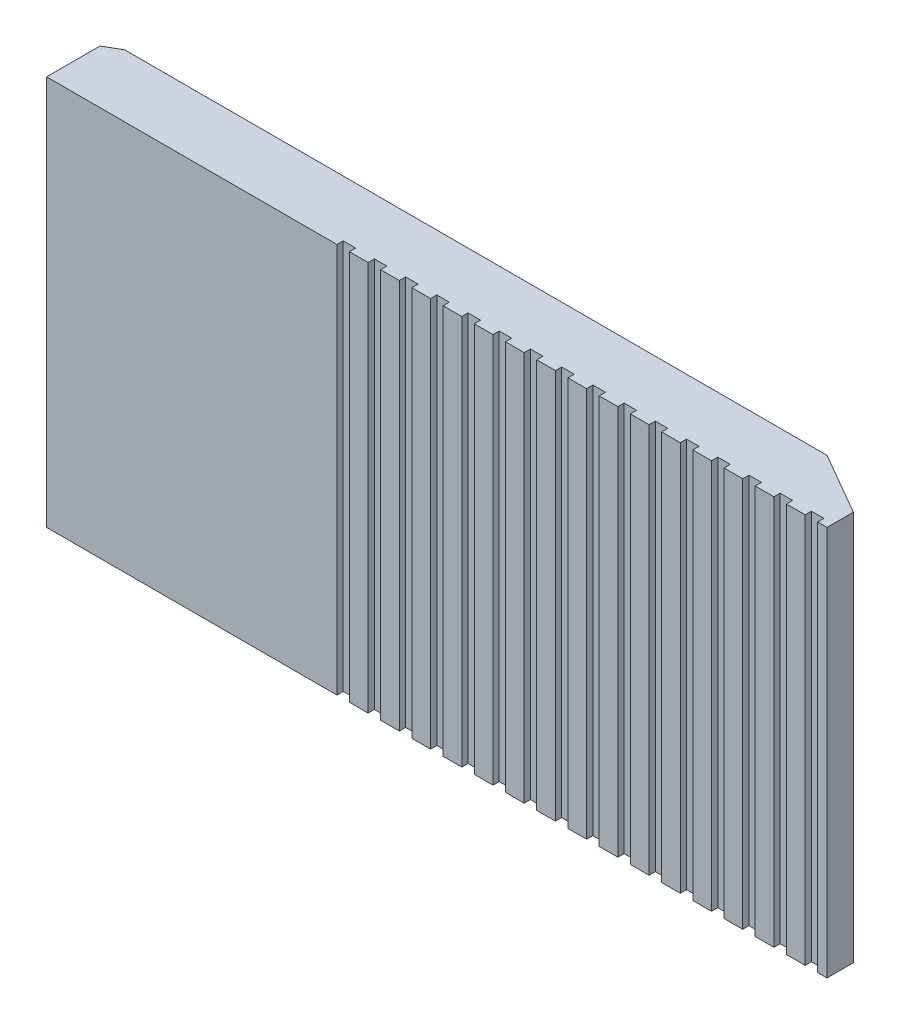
from build123d import *

# Parameters (mm, degrees)
SZKIC1_W                    = 50
SZKIC1_H                    = 25
DODANIE_WYCI_GNI_CIE1_DEPTH = 4
SFAZOWANIE1_SIZE            = 4
SFAZOWANIE1_SIZE2           = 2.309401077
SZKIC2_W                    = 10
SZKIC2_H                    = 10
DODANIE_WYCI_GNI_CIE2_DEPTH = 5.5
WYTNIJ_WYCI_GNI_CIE1_REACH  = 37.781
SZKIC3_W                    = 0.8
SZKIC3_H                    = 0.8
SZYK_LINIOWY1_COUNT         = 16
SZYK_LINIOWY1_PITCH         = 2
SFAZOWANIE2_SIZE            = 1
SFAZOWANIE2_SIZE2           = 0.577350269


with BuildPart() as part:
    # Szkic1 → Dodanie-wyci_gni_cie1 (new body)
    with BuildSketch(Plane.XY):
        Rectangle(SZKIC1_W, SZKIC1_H)
    extrude(amount=DODANIE_WYCI_GNI_CIE1_DEPTH)

    # Sfazowanie1
    sfazowanie1_edges = [part.edges().sort_by_distance(p)[0] for p in [
        (25, 0, 0),
    ]]
    sfazowanie1_side = [part.faces().sort_by_distance(p)[0] for p in [
        (0, 0, 0),
    ]]
    chamfer(sfazowanie1_edges, length=SFAZOWANIE1_SIZE, length2=SFAZOWANIE1_SIZE2, reference=sfazowanie1_side[0])

    # Szkic2 → Dodanie-wyci_gni_cie2 (add)
    with BuildSketch(Plane(origin=(0, 0, 0), x_dir=(-1, 0, 0), z_dir=(0, 0, -1))):
        with Locations((-10, 0)):
            Rectangle(SZKIC2_W, SZKIC2_H)
    extrude(amount=DODANIE_WYCI_GNI_CIE2_DEPTH)

    # Szkic3 → Wytnij-wyci_gni_cie1 (cut, up to next)
    with BuildSketch(Plane(origin=(0, 12.5, 0), x_dir=(1, 0, 0), z_dir=(0, 1, 0)), mode=Mode.PRIVATE) as wytnij_wyci_gni_cie1_sk1:
        with Locations((24, -4)):
            Rectangle(SZKIC3_W, SZKIC3_H)
    wytnij_wyci_gni_cie1_tool1 = extrude(wytnij_wyci_gni_cie1_sk1.sketch, amount=-WYTNIJ_WYCI_GNI_CIE1_REACH, mode=Mode.PRIVATE) & part.part
    wytnij_wyci_gni_cie1 = wytnij_wyci_gni_cie1_tool1.solids().sort_by_distance((24, 12.5, 4))[0]
    add(wytnij_wyci_gni_cie1, mode=Mode.SUBTRACT)

    # Szyk liniowy1: Wytnij-wyci_gni_cie1 ×16
    with Locations(*[(-i * SZYK_LINIOWY1_PITCH, 0, 0) for i in range(1, SZYK_LINIOWY1_COUNT)]):
        add(wytnij_wyci_gni_cie1, mode=Mode.SUBTRACT)

    # Sfazowanie2
    sfazowanie2_edges = [part.edges().sort_by_distance(p)[0] for p in [
        (-25, 0, 0),
    ]]
    sfazowanie2_side = [part.faces().sort_by_distance(p)[0] for p in [
        (-3.142857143, 0, 0),
    ]]
    chamfer(sfazowanie2_edges, length=SFAZOWANIE2_SIZE, length2=SFAZOWANIE2_SIZE2, reference=sfazowanie2_side[0])


solid = part.part
